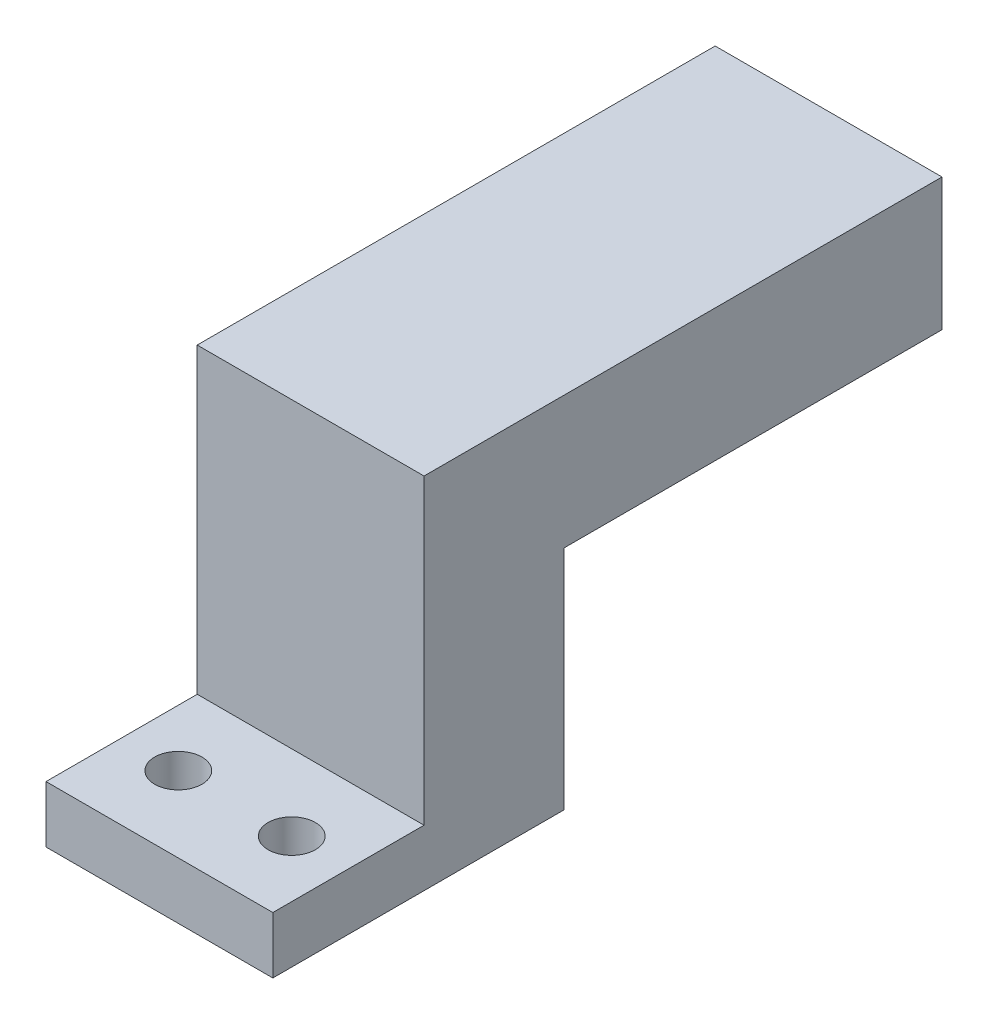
ISO-10303-21;
HEADER;
FILE_DESCRIPTION(('STEP AP214'),'2;1');
FILE_NAME('part.step','',(''),(''),'','','');
FILE_SCHEMA(('AUTOMOTIVE_DESIGN { 1 0 10303 214 1 1 1 1 }'));
ENDSEC;
DATA;
#1=APPLICATION_CONTEXT('core data for automotive mechanical design processes');
#2=APPLICATION_PROTOCOL_DEFINITION('international standard','automotive_design',2000,#1);
#3=PRODUCT_CONTEXT('',#1,'mechanical');
#4=PRODUCT('Part','Part','',(#3));
#5=PRODUCT_RELATED_PRODUCT_CATEGORY('part','',(#4));
#6=PRODUCT_DEFINITION_FORMATION('','',#4);
#7=PRODUCT_DEFINITION_CONTEXT('part definition',#1,'design');
#8=PRODUCT_DEFINITION('design','',#6,#7);
#9=PRODUCT_DEFINITION_SHAPE('','',#8);
#10=(LENGTH_UNIT() NAMED_UNIT(*) SI_UNIT(.MILLI.,.METRE.));
#11=(NAMED_UNIT(*) PLANE_ANGLE_UNIT() SI_UNIT($,.RADIAN.));
#12=(NAMED_UNIT(*) SI_UNIT($,.STERADIAN.) SOLID_ANGLE_UNIT());
#13=UNCERTAINTY_MEASURE_WITH_UNIT(LENGTH_MEASURE(1.E-05),#10,'distance_accuracy_value','');
#14=(GEOMETRIC_REPRESENTATION_CONTEXT(3) GLOBAL_UNCERTAINTY_ASSIGNED_CONTEXT((#13)) GLOBAL_UNIT_ASSIGNED_CONTEXT((#10,
#11,#12)) REPRESENTATION_CONTEXT('',''));
#15=CARTESIAN_POINT('',(0.,0.,0.));
#16=DIRECTION('',(0.,0.,1.));
#17=DIRECTION('',(1.,0.,0.));
#18=AXIS2_PLACEMENT_3D('',#15,#16,#17);
#19=CARTESIAN_POINT('',(12.,3.,0.));
#20=DIRECTION('',(0.,0.,-1.));
#21=DIRECTION('',(0.,1.,0.));
#22=AXIS2_PLACEMENT_3D('',#19,#20,#21);
#23=PLANE('',#22);
#24=DIRECTION('',(0.,-1.,0.));
#25=VECTOR('',#24,1.);
#26=CARTESIAN_POINT('',(0.,3.,0.));
#27=LINE('',#26,#25);
#28=CARTESIAN_POINT('',(0.,3.,0.));
#29=VERTEX_POINT('',#28);
#30=CARTESIAN_POINT('',(0.,0.,0.));
#31=VERTEX_POINT('',#30);
#32=EDGE_CURVE('E129',#29,#31,#27,.T.);
#33=ORIENTED_EDGE('',*,*,#32,.T.);
#34=DIRECTION('',(-1.,0.,0.));
#35=VECTOR('',#34,1.);
#36=CARTESIAN_POINT('',(12.,0.,0.));
#37=LINE('',#36,#35);
#38=CARTESIAN_POINT('',(12.,0.,0.));
#39=VERTEX_POINT('',#38);
#40=EDGE_CURVE('E11',#39,#31,#37,.T.);
#41=ORIENTED_EDGE('',*,*,#40,.F.);
#42=DIRECTION('',(0.,-1.,0.));
#43=VECTOR('',#42,1.);
#44=CARTESIAN_POINT('',(12.,3.,0.));
#45=LINE('',#44,#43);
#46=CARTESIAN_POINT('',(12.,3.,0.));
#47=VERTEX_POINT('',#46);
#48=EDGE_CURVE('E144',#47,#39,#45,.T.);
#49=ORIENTED_EDGE('',*,*,#48,.F.);
#50=DIRECTION('',(-1.,0.,0.));
#51=VECTOR('',#50,1.);
#52=CARTESIAN_POINT('',(12.,3.,0.));
#53=LINE('',#52,#51);
#54=EDGE_CURVE('E125',#47,#29,#53,.T.);
#55=ORIENTED_EDGE('',*,*,#54,.T.);
#56=EDGE_LOOP('',(#33,#41,#49,#55));
#57=FACE_BOUND('',#56,.T.);
#58=ADVANCED_FACE('F33',(#57),#23,.F.);
#59=CARTESIAN_POINT('',(12.,0.,0.));
#60=DIRECTION('',(0.,1.,0.));
#61=DIRECTION('',(0.,0.,1.));
#62=AXIS2_PLACEMENT_3D('',#59,#60,#61);
#63=PLANE('',#62);
#64=CARTESIAN_POINT('',(9.,0.,-4.));
#65=DIRECTION('',(0.,1.,0.));
#66=DIRECTION('',(0.,0.,1.));
#67=AXIS2_PLACEMENT_3D('',#64,#65,#66);
#68=CIRCLE('',#67,1.25);
#69=CARTESIAN_POINT('',(9.,0.,-2.75));
#70=VERTEX_POINT('',#69);
#71=EDGE_CURVE('E182',#70,#70,#68,.T.);
#72=ORIENTED_EDGE('',*,*,#71,.T.);
#73=EDGE_LOOP('',(#72));
#74=FACE_BOUND('',#73,.T.);
#75=CARTESIAN_POINT('',(3.,0.,-4.));
#76=DIRECTION('',(0.,1.,0.));
#77=DIRECTION('',(0.,0.,1.));
#78=AXIS2_PLACEMENT_3D('',#75,#76,#77);
#79=CIRCLE('',#78,1.25);
#80=CARTESIAN_POINT('',(3.,0.,-2.75));
#81=VERTEX_POINT('',#80);
#82=EDGE_CURVE('E133',#81,#81,#79,.T.);
#83=ORIENTED_EDGE('',*,*,#82,.T.);
#84=EDGE_LOOP('',(#83));
#85=FACE_BOUND('',#84,.T.);
#86=DIRECTION('',(0.,0.,-1.));
#87=VECTOR('',#86,1.);
#88=CARTESIAN_POINT('',(0.,0.,0.));
#89=LINE('',#88,#87);
#90=CARTESIAN_POINT('',(0.,0.,-15.4021013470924));
#91=VERTEX_POINT('',#90);
#92=EDGE_CURVE('E132',#31,#91,#89,.T.);
#93=ORIENTED_EDGE('',*,*,#92,.T.);
#94=DIRECTION('',(-1.,0.,0.));
#95=VECTOR('',#94,1.);
#96=CARTESIAN_POINT('',(12.,0.,-15.4021013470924));
#97=LINE('',#96,#95);
#98=CARTESIAN_POINT('',(12.,0.,-15.4021013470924));
#99=VERTEX_POINT('',#98);
#100=EDGE_CURVE('E41',#99,#91,#97,.T.);
#101=ORIENTED_EDGE('',*,*,#100,.F.);
#102=DIRECTION('',(0.,0.,-1.));
#103=VECTOR('',#102,1.);
#104=CARTESIAN_POINT('',(12.,0.,0.));
#105=LINE('',#104,#103);
#106=EDGE_CURVE('E92',#39,#99,#105,.T.);
#107=ORIENTED_EDGE('',*,*,#106,.F.);
#108=ORIENTED_EDGE('',*,*,#40,.T.);
#109=EDGE_LOOP('',(#93,#101,#107,#108));
#110=FACE_BOUND('',#109,.T.);
#111=ADVANCED_FACE('F204',(#74,#85,#110),#63,.F.);
#112=CARTESIAN_POINT('',(12.,0.,-15.4021013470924));
#113=DIRECTION('',(0.,0.,1.));
#114=DIRECTION('',(1.,0.,0.));
#115=AXIS2_PLACEMENT_3D('',#112,#113,#114);
#116=PLANE('',#115);
#117=DIRECTION('',(0.,1.,0.));
#118=VECTOR('',#117,1.);
#119=CARTESIAN_POINT('',(0.,0.,-15.4021013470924));
#120=LINE('',#119,#118);
#121=CARTESIAN_POINT('',(0.,12.,-15.4021013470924));
#122=VERTEX_POINT('',#121);
#123=EDGE_CURVE('E135',#91,#122,#120,.T.);
#124=ORIENTED_EDGE('',*,*,#123,.T.);
#125=DIRECTION('',(-1.,0.,0.));
#126=VECTOR('',#125,1.);
#127=CARTESIAN_POINT('',(12.,12.,-15.4021013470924));
#128=LINE('',#127,#126);
#129=CARTESIAN_POINT('',(12.,12.,-15.4021013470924));
#130=VERTEX_POINT('',#129);
#131=EDGE_CURVE('E151',#130,#122,#128,.T.);
#132=ORIENTED_EDGE('',*,*,#131,.F.);
#133=DIRECTION('',(0.,1.,0.));
#134=VECTOR('',#133,1.);
#135=CARTESIAN_POINT('',(12.,0.,-15.4021013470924));
#136=LINE('',#135,#134);
#137=EDGE_CURVE('E159',#99,#130,#136,.T.);
#138=ORIENTED_EDGE('',*,*,#137,.F.);
#139=ORIENTED_EDGE('',*,*,#100,.T.);
#140=EDGE_LOOP('',(#124,#132,#138,#139));
#141=FACE_BOUND('',#140,.T.);
#142=ADVANCED_FACE('F157',(#141),#116,.F.);
#143=CARTESIAN_POINT('',(12.,12.,-15.4021013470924));
#144=DIRECTION('',(0.,1.,0.));
#145=DIRECTION('',(0.,0.,1.));
#146=AXIS2_PLACEMENT_3D('',#143,#144,#145);
#147=PLANE('',#146);
#148=DIRECTION('',(0.,0.,-1.));
#149=VECTOR('',#148,1.);
#150=CARTESIAN_POINT('',(0.,12.,-15.4021013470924));
#151=LINE('',#150,#149);
#152=CARTESIAN_POINT('',(0.,12.,-35.4021013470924));
#153=VERTEX_POINT('',#152);
#154=EDGE_CURVE('E137',#122,#153,#151,.T.);
#155=ORIENTED_EDGE('',*,*,#154,.T.);
#156=DIRECTION('',(-1.,0.,0.));
#157=VECTOR('',#156,1.);
#158=CARTESIAN_POINT('',(12.,12.,-35.4021013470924));
#159=LINE('',#158,#157);
#160=CARTESIAN_POINT('',(12.,12.,-35.4021013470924));
#161=VERTEX_POINT('',#160);
#162=EDGE_CURVE('E148',#161,#153,#159,.T.);
#163=ORIENTED_EDGE('',*,*,#162,.F.);
#164=DIRECTION('',(0.,0.,-1.));
#165=VECTOR('',#164,1.);
#166=CARTESIAN_POINT('',(12.,12.,-15.4021013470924));
#167=LINE('',#166,#165);
#168=EDGE_CURVE('E171',#130,#161,#167,.T.);
#169=ORIENTED_EDGE('',*,*,#168,.F.);
#170=ORIENTED_EDGE('',*,*,#131,.T.);
#171=EDGE_LOOP('',(#155,#163,#169,#170));
#172=FACE_BOUND('',#171,.T.);
#173=ADVANCED_FACE('F167',(#172),#147,.F.);
#174=CARTESIAN_POINT('',(12.,12.,-35.4021013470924));
#175=DIRECTION('',(0.,0.,1.));
#176=DIRECTION('',(1.,0.,0.));
#177=AXIS2_PLACEMENT_3D('',#174,#175,#176);
#178=PLANE('',#177);
#179=DIRECTION('',(0.,1.,0.));
#180=VECTOR('',#179,1.);
#181=CARTESIAN_POINT('',(0.,12.,-35.4021013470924));
#182=LINE('',#181,#180);
#183=CARTESIAN_POINT('',(0.,19.,-35.4021013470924));
#184=VERTEX_POINT('',#183);
#185=EDGE_CURVE('E139',#153,#184,#182,.T.);
#186=ORIENTED_EDGE('',*,*,#185,.T.);
#187=DIRECTION('',(-1.,0.,0.));
#188=VECTOR('',#187,1.);
#189=CARTESIAN_POINT('',(12.,19.,-35.4021013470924));
#190=LINE('',#189,#188);
#191=CARTESIAN_POINT('',(12.,19.,-35.4021013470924));
#192=VERTEX_POINT('',#191);
#193=EDGE_CURVE('E120',#192,#184,#190,.T.);
#194=ORIENTED_EDGE('',*,*,#193,.F.);
#195=DIRECTION('',(0.,1.,0.));
#196=VECTOR('',#195,1.);
#197=CARTESIAN_POINT('',(12.,12.,-35.4021013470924));
#198=LINE('',#197,#196);
#199=EDGE_CURVE('E111',#161,#192,#198,.T.);
#200=ORIENTED_EDGE('',*,*,#199,.F.);
#201=ORIENTED_EDGE('',*,*,#162,.T.);
#202=EDGE_LOOP('',(#186,#194,#200,#201));
#203=FACE_BOUND('',#202,.T.);
#204=ADVANCED_FACE('F170',(#203),#178,.F.);
#205=CARTESIAN_POINT('',(12.,19.,-35.4021013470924));
#206=DIRECTION('',(0.,-1.,0.));
#207=DIRECTION('',(0.,0.,-1.));
#208=AXIS2_PLACEMENT_3D('',#205,#206,#207);
#209=PLANE('',#208);
#210=DIRECTION('',(0.,0.,1.));
#211=VECTOR('',#210,1.);
#212=CARTESIAN_POINT('',(0.,19.,-35.4021013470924));
#213=LINE('',#212,#211);
#214=CARTESIAN_POINT('',(0.,19.,-8.));
#215=VERTEX_POINT('',#214);
#216=EDGE_CURVE('E119',#184,#215,#213,.T.);
#217=ORIENTED_EDGE('',*,*,#216,.T.);
#218=DIRECTION('',(-1.,0.,0.));
#219=VECTOR('',#218,1.);
#220=CARTESIAN_POINT('',(12.,19.,-8.));
#221=LINE('',#220,#219);
#222=CARTESIAN_POINT('',(12.,19.,-8.));
#223=VERTEX_POINT('',#222);
#224=EDGE_CURVE('E116',#223,#215,#221,.T.);
#225=ORIENTED_EDGE('',*,*,#224,.F.);
#226=DIRECTION('',(0.,0.,1.));
#227=VECTOR('',#226,1.);
#228=CARTESIAN_POINT('',(12.,19.,-35.4021013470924));
#229=LINE('',#228,#227);
#230=EDGE_CURVE('E105',#192,#223,#229,.T.);
#231=ORIENTED_EDGE('',*,*,#230,.F.);
#232=ORIENTED_EDGE('',*,*,#193,.T.);
#233=EDGE_LOOP('',(#217,#225,#231,#232));
#234=FACE_BOUND('',#233,.T.);
#235=ADVANCED_FACE('F117',(#234),#209,.F.);
#236=CARTESIAN_POINT('',(12.,19.,-8.));
#237=DIRECTION('',(0.,0.,-1.));
#238=DIRECTION('',(0.,1.,0.));
#239=AXIS2_PLACEMENT_3D('',#236,#237,#238);
#240=PLANE('',#239);
#241=DIRECTION('',(0.,-1.,0.));
#242=VECTOR('',#241,1.);
#243=CARTESIAN_POINT('',(0.,19.,-8.));
#244=LINE('',#243,#242);
#245=CARTESIAN_POINT('',(0.,3.,-8.));
#246=VERTEX_POINT('',#245);
#247=EDGE_CURVE('E78',#215,#246,#244,.T.);
#248=ORIENTED_EDGE('',*,*,#247,.T.);
#249=DIRECTION('',(-1.,0.,0.));
#250=VECTOR('',#249,1.);
#251=CARTESIAN_POINT('',(12.,3.,-8.));
#252=LINE('',#251,#250);
#253=CARTESIAN_POINT('',(12.,3.,-8.));
#254=VERTEX_POINT('',#253);
#255=EDGE_CURVE('E121',#254,#246,#252,.T.);
#256=ORIENTED_EDGE('',*,*,#255,.F.);
#257=DIRECTION('',(0.,-1.,0.));
#258=VECTOR('',#257,1.);
#259=CARTESIAN_POINT('',(12.,19.,-8.));
#260=LINE('',#259,#258);
#261=EDGE_CURVE('E109',#223,#254,#260,.T.);
#262=ORIENTED_EDGE('',*,*,#261,.F.);
#263=ORIENTED_EDGE('',*,*,#224,.T.);
#264=EDGE_LOOP('',(#248,#256,#262,#263));
#265=FACE_BOUND('',#264,.T.);
#266=ADVANCED_FACE('F123',(#265),#240,.F.);
#267=CARTESIAN_POINT('',(12.,3.,-8.));
#268=DIRECTION('',(0.,-1.,0.));
#269=DIRECTION('',(0.,0.,-1.));
#270=AXIS2_PLACEMENT_3D('',#267,#268,#269);
#271=PLANE('',#270);
#272=CARTESIAN_POINT('',(9.,3.,-4.));
#273=DIRECTION('',(0.,1.,0.));
#274=DIRECTION('',(0.,0.,1.));
#275=AXIS2_PLACEMENT_3D('',#272,#273,#274);
#276=CIRCLE('',#275,1.25);
#277=CARTESIAN_POINT('',(9.,3.,-2.75));
#278=VERTEX_POINT('',#277);
#279=EDGE_CURVE('E185',#278,#278,#276,.T.);
#280=ORIENTED_EDGE('',*,*,#279,.F.);
#281=EDGE_LOOP('',(#280));
#282=FACE_BOUND('',#281,.T.);
#283=CARTESIAN_POINT('',(3.,3.,-4.));
#284=DIRECTION('',(0.,1.,0.));
#285=DIRECTION('',(0.,0.,1.));
#286=AXIS2_PLACEMENT_3D('',#283,#284,#285);
#287=CIRCLE('',#286,1.25);
#288=CARTESIAN_POINT('',(3.,3.,-2.75));
#289=VERTEX_POINT('',#288);
#290=EDGE_CURVE('E179',#289,#289,#287,.T.);
#291=ORIENTED_EDGE('',*,*,#290,.F.);
#292=EDGE_LOOP('',(#291));
#293=FACE_BOUND('',#292,.T.);
#294=DIRECTION('',(0.,0.,1.));
#295=VECTOR('',#294,1.);
#296=CARTESIAN_POINT('',(0.,3.,-8.));
#297=LINE('',#296,#295);
#298=EDGE_CURVE('E84',#246,#29,#297,.T.);
#299=ORIENTED_EDGE('',*,*,#298,.T.);
#300=ORIENTED_EDGE('',*,*,#54,.F.);
#301=DIRECTION('',(0.,0.,1.));
#302=VECTOR('',#301,1.);
#303=CARTESIAN_POINT('',(12.,3.,-8.));
#304=LINE('',#303,#302);
#305=EDGE_CURVE('E49',#254,#47,#304,.T.);
#306=ORIENTED_EDGE('',*,*,#305,.F.);
#307=ORIENTED_EDGE('',*,*,#255,.T.);
#308=EDGE_LOOP('',(#299,#300,#306,#307));
#309=FACE_BOUND('',#308,.T.);
#310=ADVANCED_FACE('F192',(#282,#293,#309),#271,.F.);
#311=CARTESIAN_POINT('',(12.,0.,0.));
#312=DIRECTION('',(1.,0.,0.));
#313=DIRECTION('',(0.,0.,-1.));
#314=AXIS2_PLACEMENT_3D('',#311,#312,#313);
#315=PLANE('',#314);
#316=ORIENTED_EDGE('',*,*,#48,.T.);
#317=ORIENTED_EDGE('',*,*,#106,.T.);
#318=ORIENTED_EDGE('',*,*,#137,.T.);
#319=ORIENTED_EDGE('',*,*,#168,.T.);
#320=ORIENTED_EDGE('',*,*,#199,.T.);
#321=ORIENTED_EDGE('',*,*,#230,.T.);
#322=ORIENTED_EDGE('',*,*,#261,.T.);
#323=ORIENTED_EDGE('',*,*,#305,.T.);
#324=EDGE_LOOP('',(#316,#317,#318,#319,#320,#321,#322,#323));
#325=FACE_BOUND('',#324,.T.);
#326=ADVANCED_FACE('F107',(#325),#315,.T.);
#327=CARTESIAN_POINT('',(0.,0.,0.));
#328=DIRECTION('',(1.,0.,0.));
#329=DIRECTION('',(0.,0.,-1.));
#330=AXIS2_PLACEMENT_3D('',#327,#328,#329);
#331=PLANE('',#330);
#332=ORIENTED_EDGE('',*,*,#32,.F.);
#333=ORIENTED_EDGE('',*,*,#298,.F.);
#334=ORIENTED_EDGE('',*,*,#247,.F.);
#335=ORIENTED_EDGE('',*,*,#216,.F.);
#336=ORIENTED_EDGE('',*,*,#185,.F.);
#337=ORIENTED_EDGE('',*,*,#154,.F.);
#338=ORIENTED_EDGE('',*,*,#123,.F.);
#339=ORIENTED_EDGE('',*,*,#92,.F.);
#340=EDGE_LOOP('',(#332,#333,#334,#335,#336,#337,#338,#339));
#341=FACE_BOUND('',#340,.T.);
#342=ADVANCED_FACE('F163',(#341),#331,.F.);
#343=CARTESIAN_POINT('',(3.,-9.,-4.));
#344=DIRECTION('',(0.,1.,0.));
#345=DIRECTION('',(0.,0.,1.));
#346=AXIS2_PLACEMENT_3D('',#343,#344,#345);
#347=CYLINDRICAL_SURFACE('',#346,1.25);
#348=ORIENTED_EDGE('',*,*,#290,.T.);
#349=EDGE_LOOP('',(#348));
#350=FACE_BOUND('',#349,.T.);
#351=ORIENTED_EDGE('',*,*,#82,.F.);
#352=EDGE_LOOP('',(#351));
#353=FACE_BOUND('',#352,.T.);
#354=ADVANCED_FACE('F198',(#350,#353),#347,.F.);
#355=CARTESIAN_POINT('',(9.,-9.,-4.));
#356=DIRECTION('',(0.,1.,0.));
#357=DIRECTION('',(0.,0.,1.));
#358=AXIS2_PLACEMENT_3D('',#355,#356,#357);
#359=CYLINDRICAL_SURFACE('',#358,1.25);
#360=ORIENTED_EDGE('',*,*,#279,.T.);
#361=EDGE_LOOP('',(#360));
#362=FACE_BOUND('',#361,.T.);
#363=ORIENTED_EDGE('',*,*,#71,.F.);
#364=EDGE_LOOP('',(#363));
#365=FACE_BOUND('',#364,.T.);
#366=ADVANCED_FACE('F189',(#362,#365),#359,.F.);
#367=CLOSED_SHELL('',(#58,#111,#142,#173,#204,#235,#266,#310,#326,#342,#354,#366));
#368=MANIFOLD_SOLID_BREP('B2',#367);
#369=ADVANCED_BREP_SHAPE_REPRESENTATION('',(#18,#368),#14);
#370=SHAPE_DEFINITION_REPRESENTATION(#9,#369);
ENDSEC;
END-ISO-10303-21;
